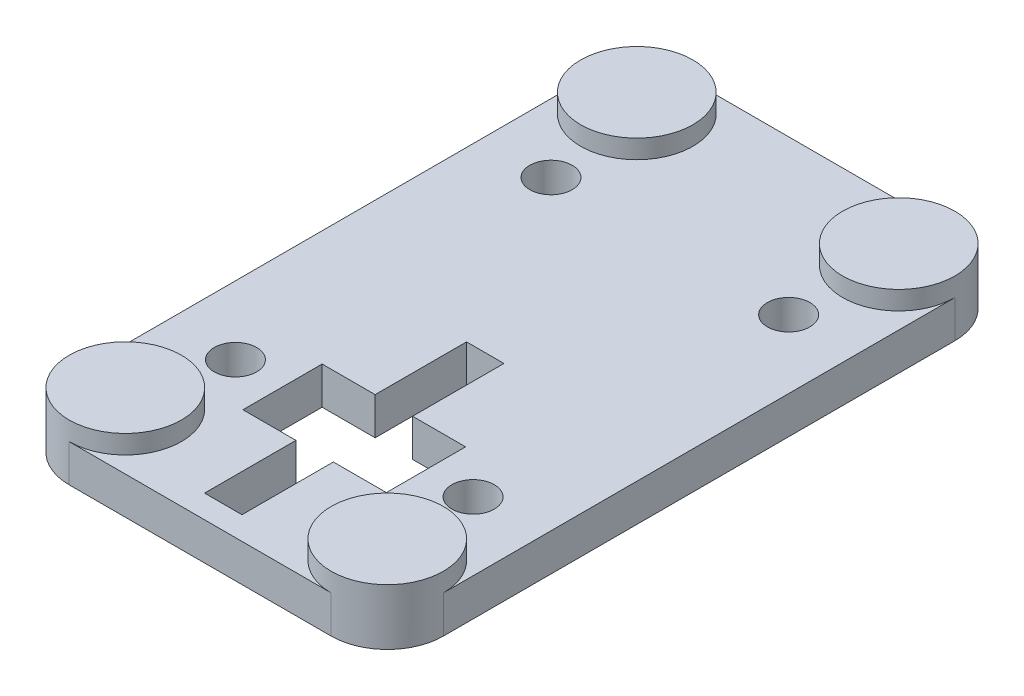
ISO-10303-21;
HEADER;
FILE_DESCRIPTION(('STEP AP214'),'2;1');
FILE_NAME('part.step','',(''),(''),'','','');
FILE_SCHEMA(('AUTOMOTIVE_DESIGN { 1 0 10303 214 1 1 1 1 }'));
ENDSEC;
DATA;
#1=APPLICATION_CONTEXT('core data for automotive mechanical design processes');
#2=APPLICATION_PROTOCOL_DEFINITION('international standard','automotive_design',2000,#1);
#3=PRODUCT_CONTEXT('',#1,'mechanical');
#4=PRODUCT('Part','Part','',(#3));
#5=PRODUCT_RELATED_PRODUCT_CATEGORY('part','',(#4));
#6=PRODUCT_DEFINITION_FORMATION('','',#4);
#7=PRODUCT_DEFINITION_CONTEXT('part definition',#1,'design');
#8=PRODUCT_DEFINITION('design','',#6,#7);
#9=PRODUCT_DEFINITION_SHAPE('','',#8);
#10=(LENGTH_UNIT() NAMED_UNIT(*) SI_UNIT(.MILLI.,.METRE.));
#11=(NAMED_UNIT(*) PLANE_ANGLE_UNIT() SI_UNIT($,.RADIAN.));
#12=(NAMED_UNIT(*) SI_UNIT($,.STERADIAN.) SOLID_ANGLE_UNIT());
#13=UNCERTAINTY_MEASURE_WITH_UNIT(LENGTH_MEASURE(1.E-05),#10,'distance_accuracy_value','');
#14=(GEOMETRIC_REPRESENTATION_CONTEXT(3) GLOBAL_UNCERTAINTY_ASSIGNED_CONTEXT((#13)) GLOBAL_UNIT_ASSIGNED_CONTEXT((#10,
#11,#12)) REPRESENTATION_CONTEXT('',''));
#15=CARTESIAN_POINT('',(0.,0.,0.));
#16=DIRECTION('',(0.,0.,1.));
#17=DIRECTION('',(1.,0.,0.));
#18=AXIS2_PLACEMENT_3D('',#15,#16,#17);
#19=CARTESIAN_POINT('',(20.75,4.5,-15.5273947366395));
#20=DIRECTION('',(0.,0.,-1.));
#21=DIRECTION('',(-1.,0.,0.));
#22=AXIS2_PLACEMENT_3D('',#19,#20,#21);
#23=PLANE('',#22);
#24=DIRECTION('',(-1.,0.,0.));
#25=VECTOR('',#24,1.);
#26=CARTESIAN_POINT('',(0.,3.,-15.5273947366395));
#27=LINE('',#26,#25);
#28=CARTESIAN_POINT('',(20.75,3.,-15.5273947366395));
#29=VERTEX_POINT('',#28);
#30=CARTESIAN_POINT('',(16.5,3.,-15.5273947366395));
#31=VERTEX_POINT('',#30);
#32=EDGE_CURVE('E265',#29,#31,#27,.T.);
#33=ORIENTED_EDGE('',*,*,#32,.T.);
#34=DIRECTION('',(0.,-1.,0.));
#35=VECTOR('',#34,1.);
#36=CARTESIAN_POINT('',(16.5,4.5,-15.5273947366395));
#37=LINE('',#36,#35);
#38=CARTESIAN_POINT('',(16.5,0.,-15.5273947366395));
#39=VERTEX_POINT('',#38);
#40=EDGE_CURVE('E226',#31,#39,#37,.T.);
#41=ORIENTED_EDGE('',*,*,#40,.T.);
#42=DIRECTION('',(-1.,0.,0.));
#43=VECTOR('',#42,1.);
#44=CARTESIAN_POINT('',(0.,0.,-15.5273947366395));
#45=LINE('',#44,#43);
#46=CARTESIAN_POINT('',(20.75,0.,-15.5273947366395));
#47=VERTEX_POINT('',#46);
#48=EDGE_CURVE('E377',#47,#39,#45,.T.);
#49=ORIENTED_EDGE('',*,*,#48,.F.);
#50=DIRECTION('',(0.,-1.,0.));
#51=VECTOR('',#50,1.);
#52=CARTESIAN_POINT('',(20.75,4.5,-15.5273947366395));
#53=LINE('',#52,#51);
#54=EDGE_CURVE('E248',#29,#47,#53,.T.);
#55=ORIENTED_EDGE('',*,*,#54,.F.);
#56=EDGE_LOOP('',(#33,#41,#49,#55));
#57=FACE_BOUND('',#56,.T.);
#58=ADVANCED_FACE('F33',(#57),#23,.F.);
#59=CARTESIAN_POINT('',(20.75,4.5,-9.1773947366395));
#60=DIRECTION('',(0.,0.,1.));
#61=DIRECTION('',(1.,0.,0.));
#62=AXIS2_PLACEMENT_3D('',#59,#60,#61);
#63=PLANE('',#62);
#64=DIRECTION('',(1.,0.,0.));
#65=VECTOR('',#64,1.);
#66=CARTESIAN_POINT('',(0.,0.,-9.1773947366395));
#67=LINE('',#66,#65);
#68=CARTESIAN_POINT('',(16.5,0.,-9.1773947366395));
#69=VERTEX_POINT('',#68);
#70=CARTESIAN_POINT('',(20.75,0.,-9.1773947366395));
#71=VERTEX_POINT('',#70);
#72=EDGE_CURVE('E332',#69,#71,#67,.T.);
#73=ORIENTED_EDGE('',*,*,#72,.F.);
#74=DIRECTION('',(0.,1.,0.));
#75=VECTOR('',#74,1.);
#76=CARTESIAN_POINT('',(16.5,4.5,-9.1773947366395));
#77=LINE('',#76,#75);
#78=CARTESIAN_POINT('',(16.5,3.,-9.1773947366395));
#79=VERTEX_POINT('',#78);
#80=EDGE_CURVE('E389',#69,#79,#77,.T.);
#81=ORIENTED_EDGE('',*,*,#80,.T.);
#82=DIRECTION('',(1.,0.,0.));
#83=VECTOR('',#82,1.);
#84=CARTESIAN_POINT('',(0.,3.,-9.1773947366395));
#85=LINE('',#84,#83);
#86=CARTESIAN_POINT('',(20.75,3.,-9.1773947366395));
#87=VERTEX_POINT('',#86);
#88=EDGE_CURVE('E251',#79,#87,#85,.T.);
#89=ORIENTED_EDGE('',*,*,#88,.T.);
#90=DIRECTION('',(0.,-1.,0.));
#91=VECTOR('',#90,1.);
#92=CARTESIAN_POINT('',(20.75,4.5,-9.1773947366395));
#93=LINE('',#92,#91);
#94=EDGE_CURVE('E247',#87,#71,#93,.T.);
#95=ORIENTED_EDGE('',*,*,#94,.T.);
#96=EDGE_LOOP('',(#73,#81,#89,#95));
#97=FACE_BOUND('',#96,.T.);
#98=ADVANCED_FACE('F396',(#97),#63,.F.);
#99=CARTESIAN_POINT('',(0.,3.,0.));
#100=DIRECTION('',(1.,0.,0.));
#101=DIRECTION('',(0.,0.,-1.));
#102=AXIS2_PLACEMENT_3D('',#99,#100,#101);
#103=PLANE('',#102);
#104=DIRECTION('',(0.,1.,0.));
#105=VECTOR('',#104,1.);
#106=CARTESIAN_POINT('',(0.,0.,-4.5));
#107=LINE('',#106,#105);
#108=CARTESIAN_POINT('',(0.,0.,-4.5));
#109=VERTEX_POINT('',#108);
#110=CARTESIAN_POINT('',(0.,3.,-4.5));
#111=VERTEX_POINT('',#110);
#112=EDGE_CURVE('E284',#109,#111,#107,.T.);
#113=ORIENTED_EDGE('',*,*,#112,.T.);
#114=DIRECTION('',(0.,0.,1.));
#115=VECTOR('',#114,1.);
#116=CARTESIAN_POINT('',(0.,3.,0.));
#117=LINE('',#116,#115);
#118=CARTESIAN_POINT('',(0.,3.,-45.5));
#119=VERTEX_POINT('',#118);
#120=EDGE_CURVE('E349',#119,#111,#117,.T.);
#121=ORIENTED_EDGE('',*,*,#120,.F.);
#122=DIRECTION('',(0.,1.,0.));
#123=VECTOR('',#122,1.);
#124=CARTESIAN_POINT('',(0.,0.,-45.5));
#125=LINE('',#124,#123);
#126=CARTESIAN_POINT('',(0.,0.,-45.5));
#127=VERTEX_POINT('',#126);
#128=EDGE_CURVE('E295',#127,#119,#125,.T.);
#129=ORIENTED_EDGE('',*,*,#128,.F.);
#130=DIRECTION('',(0.,0.,1.));
#131=VECTOR('',#130,1.);
#132=CARTESIAN_POINT('',(0.,0.,0.));
#133=LINE('',#132,#131);
#134=EDGE_CURVE('E348',#127,#109,#133,.T.);
#135=ORIENTED_EDGE('',*,*,#134,.T.);
#136=EDGE_LOOP('',(#113,#121,#129,#135));
#137=FACE_BOUND('',#136,.T.);
#138=ADVANCED_FACE('F35',(#137),#103,.F.);
#139=CARTESIAN_POINT('',(30.,3.,0.));
#140=DIRECTION('',(0.,0.,-1.));
#141=DIRECTION('',(-1.,0.,0.));
#142=AXIS2_PLACEMENT_3D('',#139,#140,#141);
#143=PLANE('',#142);
#144=DIRECTION('',(1.,0.,0.));
#145=VECTOR('',#144,1.);
#146=CARTESIAN_POINT('',(30.,3.,0.));
#147=LINE('',#146,#145);
#148=CARTESIAN_POINT('',(4.5,3.,0.));
#149=VERTEX_POINT('',#148);
#150=CARTESIAN_POINT('',(25.5,3.,0.));
#151=VERTEX_POINT('',#150);
#152=EDGE_CURVE('E352',#149,#151,#147,.T.);
#153=ORIENTED_EDGE('',*,*,#152,.F.);
#154=DIRECTION('',(0.,1.,0.));
#155=VECTOR('',#154,1.);
#156=CARTESIAN_POINT('',(4.5,0.,0.));
#157=LINE('',#156,#155);
#158=CARTESIAN_POINT('',(4.5,0.,0.));
#159=VERTEX_POINT('',#158);
#160=EDGE_CURVE('E289',#159,#149,#157,.T.);
#161=ORIENTED_EDGE('',*,*,#160,.F.);
#162=DIRECTION('',(1.,0.,0.));
#163=VECTOR('',#162,1.);
#164=CARTESIAN_POINT('',(30.,0.,0.));
#165=LINE('',#164,#163);
#166=CARTESIAN_POINT('',(25.5,0.,0.));
#167=VERTEX_POINT('',#166);
#168=EDGE_CURVE('E363',#159,#167,#165,.T.);
#169=ORIENTED_EDGE('',*,*,#168,.T.);
#170=DIRECTION('',(0.,1.,0.));
#171=VECTOR('',#170,1.);
#172=CARTESIAN_POINT('',(25.5,0.,0.));
#173=LINE('',#172,#171);
#174=EDGE_CURVE('E275',#167,#151,#173,.T.);
#175=ORIENTED_EDGE('',*,*,#174,.T.);
#176=EDGE_LOOP('',(#153,#161,#169,#175));
#177=FACE_BOUND('',#176,.T.);
#178=ADVANCED_FACE('F529',(#177),#143,.F.);
#179=CARTESIAN_POINT('',(30.,3.,0.));
#180=DIRECTION('',(-1.,0.,0.));
#181=DIRECTION('',(0.,0.,1.));
#182=AXIS2_PLACEMENT_3D('',#179,#180,#181);
#183=PLANE('',#182);
#184=DIRECTION('',(0.,0.,-1.));
#185=VECTOR('',#184,1.);
#186=CARTESIAN_POINT('',(30.,3.,0.));
#187=LINE('',#186,#185);
#188=CARTESIAN_POINT('',(30.,3.,-4.50000000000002));
#189=VERTEX_POINT('',#188);
#190=CARTESIAN_POINT('',(30.,3.,-45.5));
#191=VERTEX_POINT('',#190);
#192=EDGE_CURVE('E356',#189,#191,#187,.T.);
#193=ORIENTED_EDGE('',*,*,#192,.F.);
#194=DIRECTION('',(0.,1.,0.));
#195=VECTOR('',#194,1.);
#196=CARTESIAN_POINT('',(30.,0.,-4.50000000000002));
#197=LINE('',#196,#195);
#198=CARTESIAN_POINT('',(30.,0.,-4.50000000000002));
#199=VERTEX_POINT('',#198);
#200=EDGE_CURVE('E283',#199,#189,#197,.T.);
#201=ORIENTED_EDGE('',*,*,#200,.F.);
#202=DIRECTION('',(0.,0.,-1.));
#203=VECTOR('',#202,1.);
#204=CARTESIAN_POINT('',(30.,0.,0.));
#205=LINE('',#204,#203);
#206=CARTESIAN_POINT('',(30.,0.,-45.5));
#207=VERTEX_POINT('',#206);
#208=EDGE_CURVE('E366',#199,#207,#205,.T.);
#209=ORIENTED_EDGE('',*,*,#208,.T.);
#210=DIRECTION('',(0.,1.,0.));
#211=VECTOR('',#210,1.);
#212=CARTESIAN_POINT('',(30.,0.,-45.5));
#213=LINE('',#212,#211);
#214=EDGE_CURVE('E276',#207,#191,#213,.T.);
#215=ORIENTED_EDGE('',*,*,#214,.T.);
#216=EDGE_LOOP('',(#193,#201,#209,#215));
#217=FACE_BOUND('',#216,.T.);
#218=ADVANCED_FACE('F526',(#217),#183,.F.);
#219=CARTESIAN_POINT('',(30.,3.,-50.));
#220=DIRECTION('',(0.,0.,1.));
#221=DIRECTION('',(1.,0.,0.));
#222=AXIS2_PLACEMENT_3D('',#219,#220,#221);
#223=PLANE('',#222);
#224=DIRECTION('',(-1.,0.,0.));
#225=VECTOR('',#224,1.);
#226=CARTESIAN_POINT('',(30.,3.,-50.));
#227=LINE('',#226,#225);
#228=CARTESIAN_POINT('',(25.5,3.,-50.));
#229=VERTEX_POINT('',#228);
#230=CARTESIAN_POINT('',(4.49999999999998,3.,-50.));
#231=VERTEX_POINT('',#230);
#232=EDGE_CURVE('E333',#229,#231,#227,.T.);
#233=ORIENTED_EDGE('',*,*,#232,.F.);
#234=DIRECTION('',(0.,1.,0.));
#235=VECTOR('',#234,1.);
#236=CARTESIAN_POINT('',(25.5,0.,-50.));
#237=LINE('',#236,#235);
#238=CARTESIAN_POINT('',(25.5,0.,-50.));
#239=VERTEX_POINT('',#238);
#240=EDGE_CURVE('E274',#239,#229,#237,.T.);
#241=ORIENTED_EDGE('',*,*,#240,.F.);
#242=DIRECTION('',(-1.,0.,0.));
#243=VECTOR('',#242,1.);
#244=CARTESIAN_POINT('',(30.,0.,-50.));
#245=LINE('',#244,#243);
#246=CARTESIAN_POINT('',(4.49999999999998,0.,-50.));
#247=VERTEX_POINT('',#246);
#248=EDGE_CURVE('E353',#239,#247,#245,.T.);
#249=ORIENTED_EDGE('',*,*,#248,.T.);
#250=DIRECTION('',(0.,1.,0.));
#251=VECTOR('',#250,1.);
#252=CARTESIAN_POINT('',(4.49999999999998,0.,-50.));
#253=LINE('',#252,#251);
#254=EDGE_CURVE('E294',#247,#231,#253,.T.);
#255=ORIENTED_EDGE('',*,*,#254,.T.);
#256=EDGE_LOOP('',(#233,#241,#249,#255));
#257=FACE_BOUND('',#256,.T.);
#258=ADVANCED_FACE('F520',(#257),#223,.F.);
#259=CARTESIAN_POINT('',(0.,3.,0.));
#260=DIRECTION('',(0.,1.,0.));
#261=DIRECTION('',(0.,0.,1.));
#262=AXIS2_PLACEMENT_3D('',#259,#260,#261);
#263=PLANE('',#262);
#264=DIRECTION('',(0.,0.,-1.));
#265=VECTOR('',#264,1.);
#266=CARTESIAN_POINT('',(16.5,3.,0.));
#267=LINE('',#266,#265);
#268=CARTESIAN_POINT('',(16.5,3.,-22.8523947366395));
#269=VERTEX_POINT('',#268);
#270=EDGE_CURVE('E222',#31,#269,#267,.T.);
#271=ORIENTED_EDGE('',*,*,#270,.F.);
#272=ORIENTED_EDGE('',*,*,#32,.F.);
#273=DIRECTION('',(0.,0.,-1.));
#274=VECTOR('',#273,1.);
#275=CARTESIAN_POINT('',(20.75,3.,0.));
#276=LINE('',#275,#274);
#277=EDGE_CURVE('E268',#87,#29,#276,.T.);
#278=ORIENTED_EDGE('',*,*,#277,.F.);
#279=ORIENTED_EDGE('',*,*,#88,.F.);
#280=CARTESIAN_POINT('',(16.5,3.,-1.8523947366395));
#281=VERTEX_POINT('',#280);
#282=EDGE_CURVE('E197',#281,#79,#267,.T.);
#283=ORIENTED_EDGE('',*,*,#282,.F.);
#284=DIRECTION('',(1.,0.,0.));
#285=VECTOR('',#284,1.);
#286=CARTESIAN_POINT('',(0.,3.,-1.8523947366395));
#287=LINE('',#286,#285);
#288=CARTESIAN_POINT('',(13.5000000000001,3.,-1.8523947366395));
#289=VERTEX_POINT('',#288);
#290=EDGE_CURVE('E181',#289,#281,#287,.T.);
#291=ORIENTED_EDGE('',*,*,#290,.F.);
#292=DIRECTION('',(0.,0.,1.));
#293=VECTOR('',#292,1.);
#294=CARTESIAN_POINT('',(13.5000000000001,3.,0.));
#295=LINE('',#294,#293);
#296=CARTESIAN_POINT('',(13.5000000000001,3.,-9.1773947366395));
#297=VERTEX_POINT('',#296);
#298=EDGE_CURVE('E195',#297,#289,#295,.T.);
#299=ORIENTED_EDGE('',*,*,#298,.F.);
#300=CARTESIAN_POINT('',(9.25000000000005,3.,-9.1773947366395));
#301=VERTEX_POINT('',#300);
#302=EDGE_CURVE('E260',#301,#297,#85,.T.);
#303=ORIENTED_EDGE('',*,*,#302,.F.);
#304=DIRECTION('',(0.,0.,1.));
#305=VECTOR('',#304,1.);
#306=CARTESIAN_POINT('',(9.25000000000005,3.,0.));
#307=LINE('',#306,#305);
#308=CARTESIAN_POINT('',(9.25000000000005,3.,-15.5273947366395));
#309=VERTEX_POINT('',#308);
#310=EDGE_CURVE('E262',#309,#301,#307,.T.);
#311=ORIENTED_EDGE('',*,*,#310,.F.);
#312=CARTESIAN_POINT('',(13.5000000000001,3.,-15.5273947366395));
#313=VERTEX_POINT('',#312);
#314=EDGE_CURVE('E192',#313,#309,#27,.T.);
#315=ORIENTED_EDGE('',*,*,#314,.F.);
#316=CARTESIAN_POINT('',(13.5000000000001,3.,-22.8523947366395));
#317=VERTEX_POINT('',#316);
#318=EDGE_CURVE('E48',#317,#313,#295,.T.);
#319=ORIENTED_EDGE('',*,*,#318,.F.);
#320=DIRECTION('',(-1.,0.,0.));
#321=VECTOR('',#320,1.);
#322=CARTESIAN_POINT('',(0.,3.,-22.8523947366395));
#323=LINE('',#322,#321);
#324=EDGE_CURVE('E173',#269,#317,#323,.T.);
#325=ORIENTED_EDGE('',*,*,#324,.F.);
#326=EDGE_LOOP('',(#271,#272,#278,#279,#283,#291,#299,#303,#311,#315,#319,#325));
#327=FACE_BOUND('',#326,.T.);
#328=CARTESIAN_POINT('',(5.47500000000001,3.,-37.6476052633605));
#329=DIRECTION('',(0.,1.,0.));
#330=DIRECTION('',(0.,0.,1.));
#331=AXIS2_PLACEMENT_3D('',#328,#329,#330);
#332=CIRCLE('',#331,1.69999999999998);
#333=CARTESIAN_POINT('',(5.47500000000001,3.,-35.9476052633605));
#334=VERTEX_POINT('',#333);
#335=EDGE_CURVE('E232',#334,#334,#332,.T.);
#336=ORIENTED_EDGE('',*,*,#335,.F.);
#337=EDGE_LOOP('',(#336));
#338=FACE_BOUND('',#337,.T.);
#339=CARTESIAN_POINT('',(24.525,3.,-37.6476052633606));
#340=DIRECTION('',(0.,1.,0.));
#341=DIRECTION('',(0.,0.,1.));
#342=AXIS2_PLACEMENT_3D('',#339,#340,#341);
#343=CIRCLE('',#342,1.69999999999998);
#344=CARTESIAN_POINT('',(24.525,3.,-35.9476052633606));
#345=VERTEX_POINT('',#344);
#346=EDGE_CURVE('E228',#345,#345,#343,.T.);
#347=ORIENTED_EDGE('',*,*,#346,.F.);
#348=EDGE_LOOP('',(#347));
#349=FACE_BOUND('',#348,.T.);
#350=CARTESIAN_POINT('',(24.525,3.,-12.3523947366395));
#351=DIRECTION('',(0.,1.,0.));
#352=DIRECTION('',(0.,0.,1.));
#353=AXIS2_PLACEMENT_3D('',#350,#351,#352);
#354=CIRCLE('',#353,1.69999999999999);
#355=CARTESIAN_POINT('',(24.525,3.,-10.6523947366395));
#356=VERTEX_POINT('',#355);
#357=EDGE_CURVE('E244',#356,#356,#354,.T.);
#358=ORIENTED_EDGE('',*,*,#357,.F.);
#359=EDGE_LOOP('',(#358));
#360=FACE_BOUND('',#359,.T.);
#361=CARTESIAN_POINT('',(5.47500000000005,3.,-12.3523947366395));
#362=DIRECTION('',(0.,1.,0.));
#363=DIRECTION('',(0.,0.,1.));
#364=AXIS2_PLACEMENT_3D('',#361,#362,#363);
#365=CIRCLE('',#364,1.69999999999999);
#366=CARTESIAN_POINT('',(5.47500000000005,3.,-10.6523947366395));
#367=VERTEX_POINT('',#366);
#368=EDGE_CURVE('E239',#367,#367,#365,.T.);
#369=ORIENTED_EDGE('',*,*,#368,.F.);
#370=EDGE_LOOP('',(#369));
#371=FACE_BOUND('',#370,.T.);
#372=ORIENTED_EDGE('',*,*,#152,.T.);
#373=CARTESIAN_POINT('',(25.5,3.,-4.50000000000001));
#374=DIRECTION('',(0.,1.,0.));
#375=DIRECTION('',(0.,0.,1.));
#376=AXIS2_PLACEMENT_3D('',#373,#374,#375);
#377=CIRCLE('',#376,4.49999999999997);
#378=EDGE_CURVE('E297',#189,#151,#377,.T.);
#379=ORIENTED_EDGE('',*,*,#378,.F.);
#380=ORIENTED_EDGE('',*,*,#192,.T.);
#381=CARTESIAN_POINT('',(25.5,3.,-45.5));
#382=DIRECTION('',(0.,1.,0.));
#383=DIRECTION('',(0.,0.,1.));
#384=AXIS2_PLACEMENT_3D('',#381,#382,#383);
#385=CIRCLE('',#384,4.50000000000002);
#386=EDGE_CURVE('E316',#229,#191,#385,.T.);
#387=ORIENTED_EDGE('',*,*,#386,.F.);
#388=ORIENTED_EDGE('',*,*,#232,.T.);
#389=CARTESIAN_POINT('',(4.49999999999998,3.,-45.5));
#390=DIRECTION('',(0.,1.,0.));
#391=DIRECTION('',(0.,0.,1.));
#392=AXIS2_PLACEMENT_3D('',#389,#390,#391);
#393=CIRCLE('',#392,4.50000000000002);
#394=EDGE_CURVE('E329',#119,#231,#393,.T.);
#395=ORIENTED_EDGE('',*,*,#394,.F.);
#396=ORIENTED_EDGE('',*,*,#120,.T.);
#397=CARTESIAN_POINT('',(4.5,3.,-4.5));
#398=DIRECTION('',(0.,1.,0.));
#399=DIRECTION('',(0.,0.,1.));
#400=AXIS2_PLACEMENT_3D('',#397,#398,#399);
#401=CIRCLE('',#400,4.50000000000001);
#402=EDGE_CURVE('E307',#149,#111,#401,.T.);
#403=ORIENTED_EDGE('',*,*,#402,.F.);
#404=EDGE_LOOP('',(#372,#379,#380,#387,#388,#395,#396,#403));
#405=FACE_BOUND('',#404,.T.);
#406=ADVANCED_FACE('F189',(#327,#338,#349,#360,#371,#405),#263,.T.);
#407=CARTESIAN_POINT('',(0.,0.,0.));
#408=DIRECTION('',(0.,1.,0.));
#409=DIRECTION('',(0.,0.,1.));
#410=AXIS2_PLACEMENT_3D('',#407,#408,#409);
#411=PLANE('',#410);
#412=CARTESIAN_POINT('',(5.47500000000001,0.,-37.6476052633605));
#413=DIRECTION('',(0.,1.,0.));
#414=DIRECTION('',(0.,0.,1.));
#415=AXIS2_PLACEMENT_3D('',#412,#413,#414);
#416=CIRCLE('',#415,1.69999999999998);
#417=CARTESIAN_POINT('',(5.47500000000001,0.,-35.9476052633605));
#418=VERTEX_POINT('',#417);
#419=EDGE_CURVE('E231',#418,#418,#416,.T.);
#420=ORIENTED_EDGE('',*,*,#419,.T.);
#421=EDGE_LOOP('',(#420));
#422=FACE_BOUND('',#421,.T.);
#423=CARTESIAN_POINT('',(24.525,0.,-37.6476052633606));
#424=DIRECTION('',(0.,1.,0.));
#425=DIRECTION('',(0.,0.,1.));
#426=AXIS2_PLACEMENT_3D('',#423,#424,#425);
#427=CIRCLE('',#426,1.69999999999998);
#428=CARTESIAN_POINT('',(24.525,0.,-35.9476052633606));
#429=VERTEX_POINT('',#428);
#430=EDGE_CURVE('E180',#429,#429,#427,.T.);
#431=ORIENTED_EDGE('',*,*,#430,.T.);
#432=EDGE_LOOP('',(#431));
#433=FACE_BOUND('',#432,.T.);
#434=CARTESIAN_POINT('',(24.525,0.,-12.3523947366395));
#435=DIRECTION('',(0.,1.,0.));
#436=DIRECTION('',(0.,0.,1.));
#437=AXIS2_PLACEMENT_3D('',#434,#435,#436);
#438=CIRCLE('',#437,1.69999999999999);
#439=CARTESIAN_POINT('',(24.525,0.,-10.6523947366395));
#440=VERTEX_POINT('',#439);
#441=EDGE_CURVE('E236',#440,#440,#438,.T.);
#442=ORIENTED_EDGE('',*,*,#441,.T.);
#443=EDGE_LOOP('',(#442));
#444=FACE_BOUND('',#443,.T.);
#445=CARTESIAN_POINT('',(5.47500000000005,0.,-12.3523947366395));
#446=DIRECTION('',(0.,1.,0.));
#447=DIRECTION('',(0.,0.,1.));
#448=AXIS2_PLACEMENT_3D('',#445,#446,#447);
#449=CIRCLE('',#448,1.69999999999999);
#450=CARTESIAN_POINT('',(5.47500000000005,0.,-10.6523947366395));
#451=VERTEX_POINT('',#450);
#452=EDGE_CURVE('E235',#451,#451,#449,.T.);
#453=ORIENTED_EDGE('',*,*,#452,.T.);
#454=EDGE_LOOP('',(#453));
#455=FACE_BOUND('',#454,.T.);
#456=ORIENTED_EDGE('',*,*,#48,.T.);
#457=DIRECTION('',(0.,0.,-1.));
#458=VECTOR('',#457,1.);
#459=CARTESIAN_POINT('',(16.5,0.,0.));
#460=LINE('',#459,#458);
#461=CARTESIAN_POINT('',(16.5,0.,-22.8523947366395));
#462=VERTEX_POINT('',#461);
#463=EDGE_CURVE('E199',#39,#462,#460,.T.);
#464=ORIENTED_EDGE('',*,*,#463,.T.);
#465=DIRECTION('',(-1.,0.,0.));
#466=VECTOR('',#465,1.);
#467=CARTESIAN_POINT('',(0.,0.,-22.8523947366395));
#468=LINE('',#467,#466);
#469=CARTESIAN_POINT('',(13.5000000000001,0.,-22.8523947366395));
#470=VERTEX_POINT('',#469);
#471=EDGE_CURVE('E11',#462,#470,#468,.T.);
#472=ORIENTED_EDGE('',*,*,#471,.T.);
#473=DIRECTION('',(0.,0.,1.));
#474=VECTOR('',#473,1.);
#475=CARTESIAN_POINT('',(13.5000000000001,0.,0.));
#476=LINE('',#475,#474);
#477=CARTESIAN_POINT('',(13.5000000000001,0.,-15.5273947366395));
#478=VERTEX_POINT('',#477);
#479=EDGE_CURVE('E185',#470,#478,#476,.T.);
#480=ORIENTED_EDGE('',*,*,#479,.T.);
#481=CARTESIAN_POINT('',(9.25000000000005,0.,-15.5273947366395));
#482=VERTEX_POINT('',#481);
#483=EDGE_CURVE('E376',#478,#482,#45,.T.);
#484=ORIENTED_EDGE('',*,*,#483,.T.);
#485=DIRECTION('',(0.,0.,1.));
#486=VECTOR('',#485,1.);
#487=CARTESIAN_POINT('',(9.25000000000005,0.,0.));
#488=LINE('',#487,#486);
#489=CARTESIAN_POINT('',(9.25000000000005,0.,-9.1773947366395));
#490=VERTEX_POINT('',#489);
#491=EDGE_CURVE('E373',#482,#490,#488,.T.);
#492=ORIENTED_EDGE('',*,*,#491,.T.);
#493=CARTESIAN_POINT('',(13.5000000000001,0.,-9.1773947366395));
#494=VERTEX_POINT('',#493);
#495=EDGE_CURVE('E371',#490,#494,#67,.T.);
#496=ORIENTED_EDGE('',*,*,#495,.T.);
#497=CARTESIAN_POINT('',(13.5000000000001,0.,-1.8523947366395));
#498=VERTEX_POINT('',#497);
#499=EDGE_CURVE('E56',#494,#498,#476,.T.);
#500=ORIENTED_EDGE('',*,*,#499,.T.);
#501=DIRECTION('',(1.,0.,0.));
#502=VECTOR('',#501,1.);
#503=CARTESIAN_POINT('',(0.,0.,-1.8523947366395));
#504=LINE('',#503,#502);
#505=CARTESIAN_POINT('',(16.5,0.,-1.8523947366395));
#506=VERTEX_POINT('',#505);
#507=EDGE_CURVE('E41',#498,#506,#504,.T.);
#508=ORIENTED_EDGE('',*,*,#507,.T.);
#509=EDGE_CURVE('E193',#506,#69,#460,.T.);
#510=ORIENTED_EDGE('',*,*,#509,.T.);
#511=ORIENTED_EDGE('',*,*,#72,.T.);
#512=DIRECTION('',(0.,0.,-1.));
#513=VECTOR('',#512,1.);
#514=CARTESIAN_POINT('',(20.75,0.,0.));
#515=LINE('',#514,#513);
#516=EDGE_CURVE('E380',#71,#47,#515,.T.);
#517=ORIENTED_EDGE('',*,*,#516,.T.);
#518=EDGE_LOOP('',(#456,#464,#472,#480,#484,#492,#496,#500,#508,#510,#511,#517));
#519=FACE_BOUND('',#518,.T.);
#520=ORIENTED_EDGE('',*,*,#168,.F.);
#521=CARTESIAN_POINT('',(4.5,0.,-4.5));
#522=DIRECTION('',(0.,-1.,0.));
#523=DIRECTION('',(0.,0.,1.));
#524=AXIS2_PLACEMENT_3D('',#521,#522,#523);
#525=CIRCLE('',#524,4.5);
#526=EDGE_CURVE('E270',#159,#109,#525,.T.);
#527=ORIENTED_EDGE('',*,*,#526,.T.);
#528=ORIENTED_EDGE('',*,*,#134,.F.);
#529=CARTESIAN_POINT('',(4.49999999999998,0.,-45.5));
#530=DIRECTION('',(0.,-1.,0.));
#531=DIRECTION('',(0.,0.,1.));
#532=AXIS2_PLACEMENT_3D('',#529,#530,#531);
#533=CIRCLE('',#532,4.5);
#534=EDGE_CURVE('E278',#127,#247,#533,.T.);
#535=ORIENTED_EDGE('',*,*,#534,.T.);
#536=ORIENTED_EDGE('',*,*,#248,.F.);
#537=CARTESIAN_POINT('',(25.5,0.,-45.5));
#538=DIRECTION('',(0.,-1.,0.));
#539=DIRECTION('',(0.,0.,1.));
#540=AXIS2_PLACEMENT_3D('',#537,#538,#539);
#541=CIRCLE('',#540,4.50000000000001);
#542=EDGE_CURVE('E271',#239,#207,#541,.T.);
#543=ORIENTED_EDGE('',*,*,#542,.T.);
#544=ORIENTED_EDGE('',*,*,#208,.F.);
#545=CARTESIAN_POINT('',(25.5,0.,-4.50000000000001));
#546=DIRECTION('',(0.,-1.,0.));
#547=DIRECTION('',(0.,0.,1.));
#548=AXIS2_PLACEMENT_3D('',#545,#546,#547);
#549=CIRCLE('',#548,4.49999999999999);
#550=EDGE_CURVE('E280',#199,#167,#549,.T.);
#551=ORIENTED_EDGE('',*,*,#550,.T.);
#552=EDGE_LOOP('',(#520,#527,#528,#535,#536,#543,#544,#551));
#553=FACE_BOUND('',#552,.T.);
#554=CARTESIAN_POINT('',(25.5,0.,-45.5));
#555=DIRECTION('',(0.,1.,0.));
#556=DIRECTION('',(0.,0.,1.));
#557=AXIS2_PLACEMENT_3D('',#554,#555,#556);
#558=CIRCLE('',#557,3.25);
#559=CARTESIAN_POINT('',(25.5,0.,-42.25));
#560=VERTEX_POINT('',#559);
#561=EDGE_CURVE('E345',#560,#560,#558,.T.);
#562=ORIENTED_EDGE('',*,*,#561,.T.);
#563=EDGE_LOOP('',(#562));
#564=FACE_BOUND('',#563,.T.);
#565=CARTESIAN_POINT('',(4.49999999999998,0.,-45.5));
#566=DIRECTION('',(0.,1.,0.));
#567=DIRECTION('',(0.,0.,-1.));
#568=AXIS2_PLACEMENT_3D('',#565,#566,#567);
#569=CIRCLE('',#568,3.25);
#570=CARTESIAN_POINT('',(4.49999999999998,0.,-48.75));
#571=VERTEX_POINT('',#570);
#572=EDGE_CURVE('E340',#571,#571,#569,.T.);
#573=ORIENTED_EDGE('',*,*,#572,.T.);
#574=EDGE_LOOP('',(#573));
#575=FACE_BOUND('',#574,.T.);
#576=CARTESIAN_POINT('',(25.5,0.,-4.50000000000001));
#577=DIRECTION('',(0.,1.,0.));
#578=DIRECTION('',(0.,0.,-1.));
#579=AXIS2_PLACEMENT_3D('',#576,#577,#578);
#580=CIRCLE('',#579,3.25);
#581=CARTESIAN_POINT('',(25.5,0.,-7.75000000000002));
#582=VERTEX_POINT('',#581);
#583=EDGE_CURVE('E337',#582,#582,#580,.T.);
#584=ORIENTED_EDGE('',*,*,#583,.T.);
#585=EDGE_LOOP('',(#584));
#586=FACE_BOUND('',#585,.T.);
#587=CARTESIAN_POINT('',(4.5,0.,-4.5));
#588=DIRECTION('',(0.,1.,0.));
#589=DIRECTION('',(0.,0.,1.));
#590=AXIS2_PLACEMENT_3D('',#587,#588,#589);
#591=CIRCLE('',#590,3.25);
#592=CARTESIAN_POINT('',(4.5,0.,-1.25));
#593=VERTEX_POINT('',#592);
#594=EDGE_CURVE('E334',#593,#593,#591,.T.);
#595=ORIENTED_EDGE('',*,*,#594,.T.);
#596=EDGE_LOOP('',(#595));
#597=FACE_BOUND('',#596,.T.);
#598=ADVANCED_FACE('F391',(#422,#433,#444,#455,#519,#553,#564,#575,#586,#597),#411,.F.);
#599=CARTESIAN_POINT('',(25.5,3.,-45.5));
#600=DIRECTION('',(0.,-1.,0.));
#601=DIRECTION('',(0.,0.,-1.));
#602=AXIS2_PLACEMENT_3D('',#599,#600,#601);
#603=CYLINDRICAL_SURFACE('',#602,3.25);
#604=CARTESIAN_POINT('',(25.5,3.,-45.5));
#605=DIRECTION('',(0.,1.,0.));
#606=DIRECTION('',(0.,0.,1.));
#607=AXIS2_PLACEMENT_3D('',#604,#605,#606);
#608=CIRCLE('',#607,3.25);
#609=CARTESIAN_POINT('',(25.5,3.,-42.25));
#610=VERTEX_POINT('',#609);
#611=EDGE_CURVE('E320',#610,#610,#608,.T.);
#612=ORIENTED_EDGE('',*,*,#611,.T.);
#613=EDGE_LOOP('',(#612));
#614=FACE_BOUND('',#613,.T.);
#615=ORIENTED_EDGE('',*,*,#561,.F.);
#616=EDGE_LOOP('',(#615));
#617=FACE_BOUND('',#616,.T.);
#618=ADVANCED_FACE('F513',(#614,#617),#603,.F.);
#619=CARTESIAN_POINT('',(4.49999999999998,3.,-45.5));
#620=DIRECTION('',(0.,-1.,0.));
#621=DIRECTION('',(0.,0.,-1.));
#622=AXIS2_PLACEMENT_3D('',#619,#620,#621);
#623=CYLINDRICAL_SURFACE('',#622,3.25);
#624=CARTESIAN_POINT('',(4.49999999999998,3.,-45.5));
#625=DIRECTION('',(0.,1.,0.));
#626=DIRECTION('',(0.,0.,-1.));
#627=AXIS2_PLACEMENT_3D('',#624,#625,#626);
#628=CIRCLE('',#627,3.25);
#629=CARTESIAN_POINT('',(4.49999999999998,3.,-48.75));
#630=VERTEX_POINT('',#629);
#631=EDGE_CURVE('E328',#630,#630,#628,.T.);
#632=ORIENTED_EDGE('',*,*,#631,.T.);
#633=EDGE_LOOP('',(#632));
#634=FACE_BOUND('',#633,.T.);
#635=ORIENTED_EDGE('',*,*,#572,.F.);
#636=EDGE_LOOP('',(#635));
#637=FACE_BOUND('',#636,.T.);
#638=ADVANCED_FACE('F509',(#634,#637),#623,.F.);
#639=CARTESIAN_POINT('',(25.5,3.,-4.50000000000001));
#640=DIRECTION('',(0.,-1.,0.));
#641=DIRECTION('',(0.,0.,-1.));
#642=AXIS2_PLACEMENT_3D('',#639,#640,#641);
#643=CYLINDRICAL_SURFACE('',#642,3.25);
#644=CARTESIAN_POINT('',(25.5,3.,-4.50000000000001));
#645=DIRECTION('',(0.,1.,0.));
#646=DIRECTION('',(0.,0.,1.));
#647=AXIS2_PLACEMENT_3D('',#644,#645,#646);
#648=CIRCLE('',#647,3.25);
#649=CARTESIAN_POINT('',(25.5,3.,-1.25000000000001));
#650=VERTEX_POINT('',#649);
#651=EDGE_CURVE('E302',#650,#650,#648,.T.);
#652=ORIENTED_EDGE('',*,*,#651,.T.);
#653=EDGE_LOOP('',(#652));
#654=FACE_BOUND('',#653,.T.);
#655=ORIENTED_EDGE('',*,*,#583,.F.);
#656=EDGE_LOOP('',(#655));
#657=FACE_BOUND('',#656,.T.);
#658=ADVANCED_FACE('F505',(#654,#657),#643,.F.);
#659=CARTESIAN_POINT('',(4.5,3.,-4.5));
#660=DIRECTION('',(0.,-1.,0.));
#661=DIRECTION('',(0.,0.,-1.));
#662=AXIS2_PLACEMENT_3D('',#659,#660,#661);
#663=CYLINDRICAL_SURFACE('',#662,3.25);
#664=CARTESIAN_POINT('',(4.5,3.,-4.5));
#665=DIRECTION('',(0.,1.,0.));
#666=DIRECTION('',(0.,0.,1.));
#667=AXIS2_PLACEMENT_3D('',#664,#665,#666);
#668=CIRCLE('',#667,3.25);
#669=CARTESIAN_POINT('',(4.5,3.,-1.25));
#670=VERTEX_POINT('',#669);
#671=EDGE_CURVE('E311',#670,#670,#668,.T.);
#672=ORIENTED_EDGE('',*,*,#671,.T.);
#673=EDGE_LOOP('',(#672));
#674=FACE_BOUND('',#673,.T.);
#675=ORIENTED_EDGE('',*,*,#594,.F.);
#676=EDGE_LOOP('',(#675));
#677=FACE_BOUND('',#676,.T.);
#678=ADVANCED_FACE('F495',(#674,#677),#663,.F.);
#679=CARTESIAN_POINT('',(4.49999999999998,4.5,-45.5));
#680=DIRECTION('',(0.,1.,0.));
#681=DIRECTION('',(0.,0.,1.));
#682=AXIS2_PLACEMENT_3D('',#679,#680,#681);
#683=PLANE('',#682);
#684=CARTESIAN_POINT('',(4.49999999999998,4.5,-45.5));
#685=DIRECTION('',(0.,1.,0.));
#686=DIRECTION('',(0.,0.,1.));
#687=AXIS2_PLACEMENT_3D('',#684,#685,#686);
#688=CIRCLE('',#687,4.50000000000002);
#689=CARTESIAN_POINT('',(4.49999999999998,4.5,-41.));
#690=VERTEX_POINT('',#689);
#691=EDGE_CURVE('E325',#690,#690,#688,.T.);
#692=ORIENTED_EDGE('',*,*,#691,.T.);
#693=EDGE_LOOP('',(#692));
#694=FACE_BOUND('',#693,.T.);
#695=ADVANCED_FACE('F491',(#694),#683,.T.);
#696=CARTESIAN_POINT('',(4.49999999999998,4.5,-45.5));
#697=DIRECTION('',(0.,-1.,0.));
#698=DIRECTION('',(0.,0.,-1.));
#699=AXIS2_PLACEMENT_3D('',#696,#697,#698);
#700=CYLINDRICAL_SURFACE('',#699,4.50000000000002);
#701=ORIENTED_EDGE('',*,*,#394,.T.);
#702=ORIENTED_EDGE('',*,*,#254,.F.);
#703=ORIENTED_EDGE('',*,*,#534,.F.);
#704=ORIENTED_EDGE('',*,*,#128,.T.);
#705=EDGE_LOOP('',(#701,#702,#703,#704));
#706=FACE_BOUND('',#705,.T.);
#707=ORIENTED_EDGE('',*,*,#691,.F.);
#708=EDGE_LOOP('',(#707));
#709=FACE_BOUND('',#708,.T.);
#710=ADVANCED_FACE('F494',(#706,#709),#700,.T.);
#711=CARTESIAN_POINT('',(4.49999999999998,3.,-45.5));
#712=DIRECTION('',(0.,1.,0.));
#713=DIRECTION('',(0.,0.,1.));
#714=AXIS2_PLACEMENT_3D('',#711,#712,#713);
#715=PLANE('',#714);
#716=ORIENTED_EDGE('',*,*,#631,.F.);
#717=EDGE_LOOP('',(#716));
#718=FACE_BOUND('',#717,.T.);
#719=ADVANCED_FACE('F486',(#718),#715,.F.);
#720=CARTESIAN_POINT('',(25.5,3.,-45.5));
#721=DIRECTION('',(0.,1.,0.));
#722=DIRECTION('',(0.,0.,1.));
#723=AXIS2_PLACEMENT_3D('',#720,#721,#722);
#724=PLANE('',#723);
#725=ORIENTED_EDGE('',*,*,#611,.F.);
#726=EDGE_LOOP('',(#725));
#727=FACE_BOUND('',#726,.T.);
#728=ADVANCED_FACE('F483',(#727),#724,.F.);
#729=CARTESIAN_POINT('',(25.5,4.5,-45.5));
#730=DIRECTION('',(0.,-1.,0.));
#731=DIRECTION('',(0.,0.,-1.));
#732=AXIS2_PLACEMENT_3D('',#729,#730,#731);
#733=CYLINDRICAL_SURFACE('',#732,4.50000000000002);
#734=ORIENTED_EDGE('',*,*,#386,.T.);
#735=ORIENTED_EDGE('',*,*,#214,.F.);
#736=ORIENTED_EDGE('',*,*,#542,.F.);
#737=ORIENTED_EDGE('',*,*,#240,.T.);
#738=EDGE_LOOP('',(#734,#735,#736,#737));
#739=FACE_BOUND('',#738,.T.);
#740=CARTESIAN_POINT('',(25.5,4.5,-45.5));
#741=DIRECTION('',(0.,1.,0.));
#742=DIRECTION('',(0.,0.,1.));
#743=AXIS2_PLACEMENT_3D('',#740,#741,#742);
#744=CIRCLE('',#743,4.50000000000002);
#745=CARTESIAN_POINT('',(25.5,4.5,-41.));
#746=VERTEX_POINT('',#745);
#747=EDGE_CURVE('E317',#746,#746,#744,.T.);
#748=ORIENTED_EDGE('',*,*,#747,.F.);
#749=EDGE_LOOP('',(#748));
#750=FACE_BOUND('',#749,.T.);
#751=ADVANCED_FACE('F481',(#739,#750),#733,.T.);
#752=CARTESIAN_POINT('',(25.5,4.5,-45.5));
#753=DIRECTION('',(0.,1.,0.));
#754=DIRECTION('',(0.,0.,1.));
#755=AXIS2_PLACEMENT_3D('',#752,#753,#754);
#756=PLANE('',#755);
#757=ORIENTED_EDGE('',*,*,#747,.T.);
#758=EDGE_LOOP('',(#757));
#759=FACE_BOUND('',#758,.T.);
#760=ADVANCED_FACE('F474',(#759),#756,.T.);
#761=CARTESIAN_POINT('',(4.5,3.,-4.5));
#762=DIRECTION('',(0.,1.,0.));
#763=DIRECTION('',(0.,0.,1.));
#764=AXIS2_PLACEMENT_3D('',#761,#762,#763);
#765=PLANE('',#764);
#766=ORIENTED_EDGE('',*,*,#671,.F.);
#767=EDGE_LOOP('',(#766));
#768=FACE_BOUND('',#767,.T.);
#769=ADVANCED_FACE('F471',(#768),#765,.F.);
#770=CARTESIAN_POINT('',(4.5,4.5,-4.5));
#771=DIRECTION('',(0.,-1.,0.));
#772=DIRECTION('',(0.,0.,-1.));
#773=AXIS2_PLACEMENT_3D('',#770,#771,#772);
#774=CYLINDRICAL_SURFACE('',#773,4.50000000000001);
#775=ORIENTED_EDGE('',*,*,#402,.T.);
#776=ORIENTED_EDGE('',*,*,#112,.F.);
#777=ORIENTED_EDGE('',*,*,#526,.F.);
#778=ORIENTED_EDGE('',*,*,#160,.T.);
#779=EDGE_LOOP('',(#775,#776,#777,#778));
#780=FACE_BOUND('',#779,.T.);
#781=CARTESIAN_POINT('',(4.5,4.5,-4.5));
#782=DIRECTION('',(0.,1.,0.));
#783=DIRECTION('',(0.,0.,1.));
#784=AXIS2_PLACEMENT_3D('',#781,#782,#783);
#785=CIRCLE('',#784,4.50000000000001);
#786=CARTESIAN_POINT('',(4.5,4.5,0.));
#787=VERTEX_POINT('',#786);
#788=EDGE_CURVE('E308',#787,#787,#785,.T.);
#789=ORIENTED_EDGE('',*,*,#788,.F.);
#790=EDGE_LOOP('',(#789));
#791=FACE_BOUND('',#790,.T.);
#792=ADVANCED_FACE('F469',(#780,#791),#774,.T.);
#793=CARTESIAN_POINT('',(4.5,4.5,-4.5));
#794=DIRECTION('',(0.,1.,0.));
#795=DIRECTION('',(0.,0.,1.));
#796=AXIS2_PLACEMENT_3D('',#793,#794,#795);
#797=PLANE('',#796);
#798=ORIENTED_EDGE('',*,*,#788,.T.);
#799=EDGE_LOOP('',(#798));
#800=FACE_BOUND('',#799,.T.);
#801=ADVANCED_FACE('F462',(#800),#797,.T.);
#802=CARTESIAN_POINT('',(25.5,3.,-4.50000000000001));
#803=DIRECTION('',(0.,1.,0.));
#804=DIRECTION('',(0.,0.,1.));
#805=AXIS2_PLACEMENT_3D('',#802,#803,#804);
#806=PLANE('',#805);
#807=ORIENTED_EDGE('',*,*,#651,.F.);
#808=EDGE_LOOP('',(#807));
#809=FACE_BOUND('',#808,.T.);
#810=ADVANCED_FACE('F459',(#809),#806,.F.);
#811=CARTESIAN_POINT('',(25.5,4.5,-4.50000000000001));
#812=DIRECTION('',(0.,-1.,0.));
#813=DIRECTION('',(0.,0.,-1.));
#814=AXIS2_PLACEMENT_3D('',#811,#812,#813);
#815=CYLINDRICAL_SURFACE('',#814,4.49999999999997);
#816=ORIENTED_EDGE('',*,*,#378,.T.);
#817=ORIENTED_EDGE('',*,*,#174,.F.);
#818=ORIENTED_EDGE('',*,*,#550,.F.);
#819=ORIENTED_EDGE('',*,*,#200,.T.);
#820=EDGE_LOOP('',(#816,#817,#818,#819));
#821=FACE_BOUND('',#820,.T.);
#822=CARTESIAN_POINT('',(25.5,4.5,-4.50000000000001));
#823=DIRECTION('',(0.,1.,0.));
#824=DIRECTION('',(0.,0.,1.));
#825=AXIS2_PLACEMENT_3D('',#822,#823,#824);
#826=CIRCLE('',#825,4.49999999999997);
#827=CARTESIAN_POINT('',(25.5,4.5,0.));
#828=VERTEX_POINT('',#827);
#829=EDGE_CURVE('E299',#828,#828,#826,.T.);
#830=ORIENTED_EDGE('',*,*,#829,.F.);
#831=EDGE_LOOP('',(#830));
#832=FACE_BOUND('',#831,.T.);
#833=ADVANCED_FACE('F457',(#821,#832),#815,.T.);
#834=CARTESIAN_POINT('',(25.5,4.5,-4.50000000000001));
#835=DIRECTION('',(0.,1.,0.));
#836=DIRECTION('',(0.,0.,1.));
#837=AXIS2_PLACEMENT_3D('',#834,#835,#836);
#838=PLANE('',#837);
#839=ORIENTED_EDGE('',*,*,#829,.T.);
#840=EDGE_LOOP('',(#839));
#841=FACE_BOUND('',#840,.T.);
#842=ADVANCED_FACE('F441',(#841),#838,.T.);
#843=CARTESIAN_POINT('',(20.75,4.5,-15.5273947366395));
#844=DIRECTION('',(1.,0.,0.));
#845=DIRECTION('',(0.,0.,-1.));
#846=AXIS2_PLACEMENT_3D('',#843,#844,#845);
#847=PLANE('',#846);
#848=ORIENTED_EDGE('',*,*,#277,.T.);
#849=ORIENTED_EDGE('',*,*,#54,.T.);
#850=ORIENTED_EDGE('',*,*,#516,.F.);
#851=ORIENTED_EDGE('',*,*,#94,.F.);
#852=EDGE_LOOP('',(#848,#849,#850,#851));
#853=FACE_BOUND('',#852,.T.);
#854=ADVANCED_FACE('F401',(#853),#847,.F.);
#855=ORIENTED_EDGE('',*,*,#483,.F.);
#856=DIRECTION('',(0.,1.,0.));
#857=VECTOR('',#856,1.);
#858=CARTESIAN_POINT('',(13.5000000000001,4.5,-15.5273947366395));
#859=LINE('',#858,#857);
#860=EDGE_CURVE('E200',#478,#313,#859,.T.);
#861=ORIENTED_EDGE('',*,*,#860,.T.);
#862=ORIENTED_EDGE('',*,*,#314,.T.);
#863=DIRECTION('',(0.,-1.,0.));
#864=VECTOR('',#863,1.);
#865=CARTESIAN_POINT('',(9.25000000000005,4.5,-15.5273947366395));
#866=LINE('',#865,#864);
#867=EDGE_CURVE('E252',#309,#482,#866,.T.);
#868=ORIENTED_EDGE('',*,*,#867,.T.);
#869=EDGE_LOOP('',(#855,#861,#862,#868));
#870=FACE_BOUND('',#869,.T.);
#871=ADVANCED_FACE('F425',(#870),#23,.F.);
#872=CARTESIAN_POINT('',(9.25000000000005,4.5,-15.5273947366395));
#873=DIRECTION('',(-1.,0.,0.));
#874=DIRECTION('',(0.,0.,1.));
#875=AXIS2_PLACEMENT_3D('',#872,#873,#874);
#876=PLANE('',#875);
#877=ORIENTED_EDGE('',*,*,#310,.T.);
#878=DIRECTION('',(0.,-1.,0.));
#879=VECTOR('',#878,1.);
#880=CARTESIAN_POINT('',(9.25000000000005,4.5,-9.1773947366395));
#881=LINE('',#880,#879);
#882=EDGE_CURVE('E255',#301,#490,#881,.T.);
#883=ORIENTED_EDGE('',*,*,#882,.T.);
#884=ORIENTED_EDGE('',*,*,#491,.F.);
#885=ORIENTED_EDGE('',*,*,#867,.F.);
#886=EDGE_LOOP('',(#877,#883,#884,#885));
#887=FACE_BOUND('',#886,.T.);
#888=ADVANCED_FACE('F434',(#887),#876,.F.);
#889=ORIENTED_EDGE('',*,*,#302,.T.);
#890=DIRECTION('',(0.,-1.,0.));
#891=VECTOR('',#890,1.);
#892=CARTESIAN_POINT('',(13.5000000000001,4.5,-9.1773947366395));
#893=LINE('',#892,#891);
#894=EDGE_CURVE('E383',#297,#494,#893,.T.);
#895=ORIENTED_EDGE('',*,*,#894,.T.);
#896=ORIENTED_EDGE('',*,*,#495,.F.);
#897=ORIENTED_EDGE('',*,*,#882,.F.);
#898=EDGE_LOOP('',(#889,#895,#896,#897));
#899=FACE_BOUND('',#898,.T.);
#900=ADVANCED_FACE('F430',(#899),#63,.F.);
#901=CARTESIAN_POINT('',(5.47500000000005,0.,-12.3523947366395));
#902=DIRECTION('',(0.,1.,0.));
#903=DIRECTION('',(0.,0.,1.));
#904=AXIS2_PLACEMENT_3D('',#901,#902,#903);
#905=CYLINDRICAL_SURFACE('',#904,1.69999999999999);
#906=ORIENTED_EDGE('',*,*,#368,.T.);
#907=EDGE_LOOP('',(#906));
#908=FACE_BOUND('',#907,.T.);
#909=ORIENTED_EDGE('',*,*,#452,.F.);
#910=EDGE_LOOP('',(#909));
#911=FACE_BOUND('',#910,.T.);
#912=ADVANCED_FACE('F448',(#908,#911),#905,.F.);
#913=CARTESIAN_POINT('',(24.525,0.,-12.3523947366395));
#914=DIRECTION('',(0.,1.,0.));
#915=DIRECTION('',(0.,0.,1.));
#916=AXIS2_PLACEMENT_3D('',#913,#914,#915);
#917=CYLINDRICAL_SURFACE('',#916,1.69999999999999);
#918=ORIENTED_EDGE('',*,*,#357,.T.);
#919=EDGE_LOOP('',(#918));
#920=FACE_BOUND('',#919,.T.);
#921=ORIENTED_EDGE('',*,*,#441,.F.);
#922=EDGE_LOOP('',(#921));
#923=FACE_BOUND('',#922,.T.);
#924=ADVANCED_FACE('F452',(#920,#923),#917,.F.);
#925=CARTESIAN_POINT('',(24.525,4.5,-37.6476052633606));
#926=DIRECTION('',(0.,-1.,0.));
#927=DIRECTION('',(0.,0.,-1.));
#928=AXIS2_PLACEMENT_3D('',#925,#926,#927);
#929=CYLINDRICAL_SURFACE('',#928,1.69999999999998);
#930=ORIENTED_EDGE('',*,*,#346,.T.);
#931=EDGE_LOOP('',(#930));
#932=FACE_BOUND('',#931,.T.);
#933=ORIENTED_EDGE('',*,*,#430,.F.);
#934=EDGE_LOOP('',(#933));
#935=FACE_BOUND('',#934,.T.);
#936=ADVANCED_FACE('F418',(#932,#935),#929,.F.);
#937=CARTESIAN_POINT('',(5.47500000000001,4.5,-37.6476052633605));
#938=DIRECTION('',(0.,-1.,0.));
#939=DIRECTION('',(0.,0.,-1.));
#940=AXIS2_PLACEMENT_3D('',#937,#938,#939);
#941=CYLINDRICAL_SURFACE('',#940,1.69999999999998);
#942=ORIENTED_EDGE('',*,*,#335,.T.);
#943=EDGE_LOOP('',(#942));
#944=FACE_BOUND('',#943,.T.);
#945=ORIENTED_EDGE('',*,*,#419,.F.);
#946=EDGE_LOOP('',(#945));
#947=FACE_BOUND('',#946,.T.);
#948=ADVANCED_FACE('F410',(#944,#947),#941,.F.);
#949=CARTESIAN_POINT('',(16.5,4.5,-22.8523947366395));
#950=DIRECTION('',(1.,0.,0.));
#951=DIRECTION('',(0.,0.,-1.));
#952=AXIS2_PLACEMENT_3D('',#949,#950,#951);
#953=PLANE('',#952);
#954=ORIENTED_EDGE('',*,*,#282,.T.);
#955=ORIENTED_EDGE('',*,*,#80,.F.);
#956=ORIENTED_EDGE('',*,*,#509,.F.);
#957=DIRECTION('',(0.,-1.,0.));
#958=VECTOR('',#957,1.);
#959=CARTESIAN_POINT('',(16.5,4.5,-1.8523947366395));
#960=LINE('',#959,#958);
#961=EDGE_CURVE('E210',#281,#506,#960,.T.);
#962=ORIENTED_EDGE('',*,*,#961,.F.);
#963=EDGE_LOOP('',(#954,#955,#956,#962));
#964=FACE_BOUND('',#963,.T.);
#965=ADVANCED_FACE('F408',(#964),#953,.F.);
#966=CARTESIAN_POINT('',(13.5000000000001,4.5,-22.8523947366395));
#967=DIRECTION('',(-1.,0.,0.));
#968=DIRECTION('',(0.,0.,1.));
#969=AXIS2_PLACEMENT_3D('',#966,#967,#968);
#970=PLANE('',#969);
#971=ORIENTED_EDGE('',*,*,#298,.T.);
#972=DIRECTION('',(0.,-1.,0.));
#973=VECTOR('',#972,1.);
#974=CARTESIAN_POINT('',(13.5000000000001,4.5,-1.8523947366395));
#975=LINE('',#974,#973);
#976=EDGE_CURVE('E186',#289,#498,#975,.T.);
#977=ORIENTED_EDGE('',*,*,#976,.T.);
#978=ORIENTED_EDGE('',*,*,#499,.F.);
#979=ORIENTED_EDGE('',*,*,#894,.F.);
#980=EDGE_LOOP('',(#971,#977,#978,#979));
#981=FACE_BOUND('',#980,.T.);
#982=ADVANCED_FACE('F213',(#981),#970,.F.);
#983=CARTESIAN_POINT('',(16.5,4.5,-1.8523947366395));
#984=DIRECTION('',(0.,0.,1.));
#985=DIRECTION('',(1.,0.,0.));
#986=AXIS2_PLACEMENT_3D('',#983,#984,#985);
#987=PLANE('',#986);
#988=ORIENTED_EDGE('',*,*,#290,.T.);
#989=ORIENTED_EDGE('',*,*,#961,.T.);
#990=ORIENTED_EDGE('',*,*,#507,.F.);
#991=ORIENTED_EDGE('',*,*,#976,.F.);
#992=EDGE_LOOP('',(#988,#989,#990,#991));
#993=FACE_BOUND('',#992,.T.);
#994=ADVANCED_FACE('F216',(#993),#987,.F.);
#995=CARTESIAN_POINT('',(16.5,4.5,-22.8523947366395));
#996=DIRECTION('',(0.,0.,-1.));
#997=DIRECTION('',(-1.,0.,0.));
#998=AXIS2_PLACEMENT_3D('',#995,#996,#997);
#999=PLANE('',#998);
#1000=ORIENTED_EDGE('',*,*,#324,.T.);
#1001=DIRECTION('',(0.,-1.,0.));
#1002=VECTOR('',#1001,1.);
#1003=CARTESIAN_POINT('',(13.5000000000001,4.5,-22.8523947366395));
#1004=LINE('',#1003,#1002);
#1005=EDGE_CURVE('E175',#317,#470,#1004,.T.);
#1006=ORIENTED_EDGE('',*,*,#1005,.T.);
#1007=ORIENTED_EDGE('',*,*,#471,.F.);
#1008=DIRECTION('',(0.,-1.,0.));
#1009=VECTOR('',#1008,1.);
#1010=CARTESIAN_POINT('',(16.5,4.5,-22.8523947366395));
#1011=LINE('',#1010,#1009);
#1012=EDGE_CURVE('E177',#269,#462,#1011,.T.);
#1013=ORIENTED_EDGE('',*,*,#1012,.F.);
#1014=EDGE_LOOP('',(#1000,#1006,#1007,#1013));
#1015=FACE_BOUND('',#1014,.T.);
#1016=ADVANCED_FACE('F174',(#1015),#999,.F.);
#1017=ORIENTED_EDGE('',*,*,#270,.T.);
#1018=ORIENTED_EDGE('',*,*,#1012,.T.);
#1019=ORIENTED_EDGE('',*,*,#463,.F.);
#1020=ORIENTED_EDGE('',*,*,#40,.F.);
#1021=EDGE_LOOP('',(#1017,#1018,#1019,#1020));
#1022=FACE_BOUND('',#1021,.T.);
#1023=ADVANCED_FACE('F412',(#1022),#953,.F.);
#1024=ORIENTED_EDGE('',*,*,#318,.T.);
#1025=ORIENTED_EDGE('',*,*,#860,.F.);
#1026=ORIENTED_EDGE('',*,*,#479,.F.);
#1027=ORIENTED_EDGE('',*,*,#1005,.F.);
#1028=EDGE_LOOP('',(#1024,#1025,#1026,#1027));
#1029=FACE_BOUND('',#1028,.T.);
#1030=ADVANCED_FACE('F183',(#1029),#970,.F.);
#1031=CLOSED_SHELL('',(#58,#98,#138,#178,#218,#258,#406,#598,#618,#638,#658,#678,#695,#710,#719,
#728,#751,#760,#769,#792,#801,#810,#833,#842,#854,#871,#888,#900,#912,#924,#936,#948,#965,#982,
#994,#1016,#1023,#1030));
#1032=MANIFOLD_SOLID_BREP('B2',#1031);
#1033=ADVANCED_BREP_SHAPE_REPRESENTATION('',(#18,#1032),#14);
#1034=SHAPE_DEFINITION_REPRESENTATION(#9,#1033);
ENDSEC;
END-ISO-10303-21;
